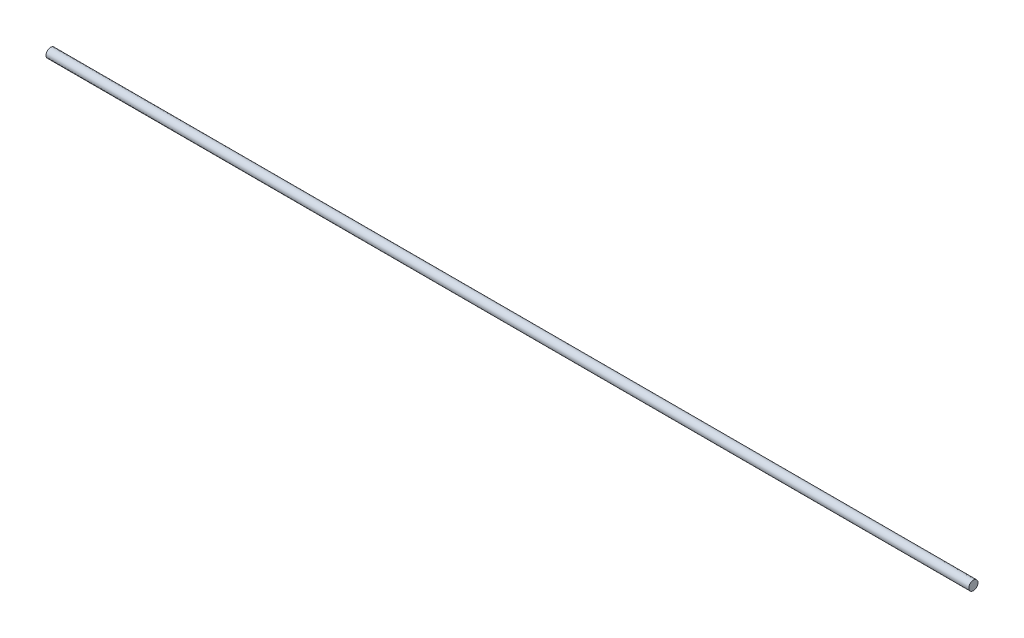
from build123d import *

# Parameters (mm, degrees)
ESQUISSE2_R      = 0.425
EXTRUSION1_DEPTH = 85


with BuildPart() as part:
    # Esquisse2 → Extrusion1 (new body)
    with BuildSketch(Plane(origin=(0, 0, 0), x_dir=(0, 0, -1), z_dir=(1, 0, 0))):
        Circle(ESQUISSE2_R)
    extrude(amount=EXTRUSION1_DEPTH)


solid = part.part
